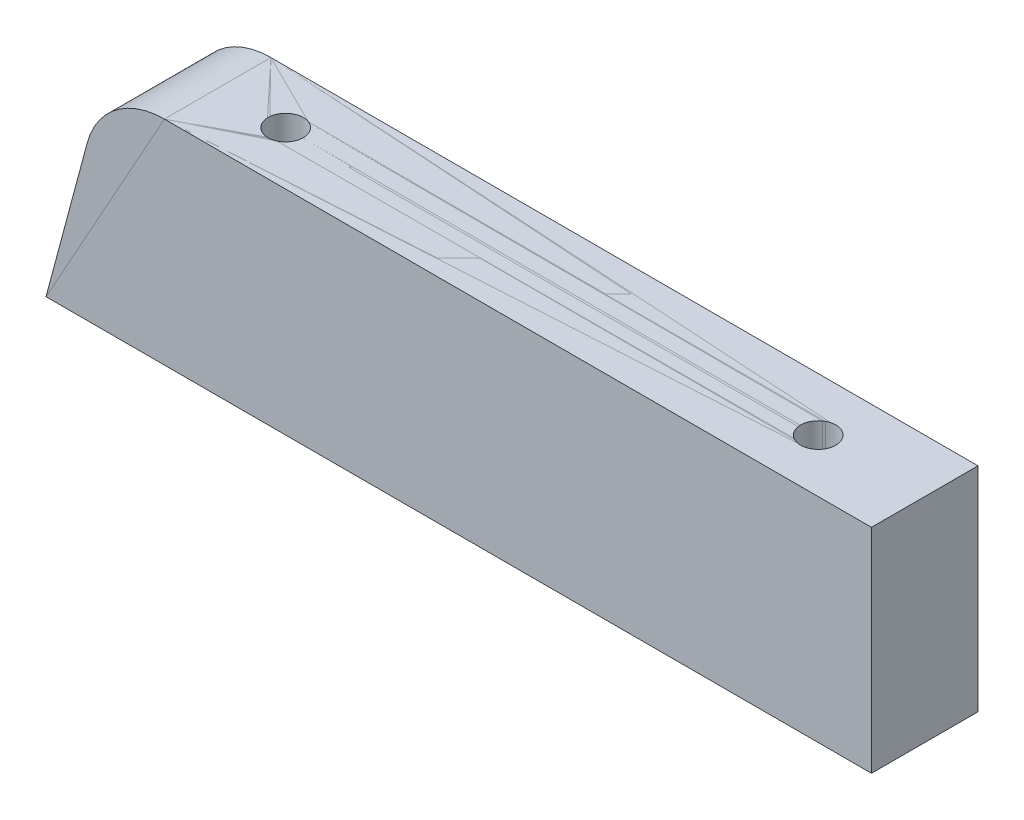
ISO-10303-21;
HEADER;
FILE_DESCRIPTION(('STEP AP214'),'2;1');
FILE_NAME('part.step','',(''),(''),'','','');
FILE_SCHEMA(('AUTOMOTIVE_DESIGN { 1 0 10303 214 1 1 1 1 }'));
ENDSEC;
DATA;
#1=APPLICATION_CONTEXT('core data for automotive mechanical design processes');
#2=APPLICATION_PROTOCOL_DEFINITION('international standard','automotive_design',2000,#1);
#3=PRODUCT_CONTEXT('',#1,'mechanical');
#4=PRODUCT('Part','Part','',(#3));
#5=PRODUCT_RELATED_PRODUCT_CATEGORY('part','',(#4));
#6=PRODUCT_DEFINITION_FORMATION('','',#4);
#7=PRODUCT_DEFINITION_CONTEXT('part definition',#1,'design');
#8=PRODUCT_DEFINITION('design','',#6,#7);
#9=PRODUCT_DEFINITION_SHAPE('','',#8);
#10=(LENGTH_UNIT() NAMED_UNIT(*) SI_UNIT(.MILLI.,.METRE.));
#11=(NAMED_UNIT(*) PLANE_ANGLE_UNIT() SI_UNIT($,.RADIAN.));
#12=(NAMED_UNIT(*) SI_UNIT($,.STERADIAN.) SOLID_ANGLE_UNIT());
#13=UNCERTAINTY_MEASURE_WITH_UNIT(LENGTH_MEASURE(1.E-05),#10,'distance_accuracy_value','');
#14=(GEOMETRIC_REPRESENTATION_CONTEXT(3) GLOBAL_UNCERTAINTY_ASSIGNED_CONTEXT((#13)) GLOBAL_UNIT_ASSIGNED_CONTEXT((#10,
#11,#12)) REPRESENTATION_CONTEXT('',''));
#15=CARTESIAN_POINT('',(0.,0.,0.));
#16=DIRECTION('',(0.,0.,1.));
#17=DIRECTION('',(1.,0.,0.));
#18=AXIS2_PLACEMENT_3D('',#15,#16,#17);
#19=CARTESIAN_POINT('',(69.843746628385,14.999999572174,-10.));
#20=DIRECTION('',(0.,-1.,0.));
#21=DIRECTION('',(0.,0.,-1.));
#22=AXIS2_PLACEMENT_3D('',#19,#20,#21);
#23=CYLINDRICAL_SURFACE('',#22,3.30000000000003);
#24=CARTESIAN_POINT('',(69.843746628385,14.999999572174,-10.));
#25=DIRECTION('',(0.,-1.,0.));
#26=DIRECTION('',(0.,0.,-1.));
#27=AXIS2_PLACEMENT_3D('',#24,#25,#26);
#28=CIRCLE('',#27,3.30000000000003);
#29=CARTESIAN_POINT('',(69.843746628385,14.999999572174,-13.3));
#30=VERTEX_POINT('',#29);
#31=EDGE_CURVE('P0_E436',#30,#30,#28,.T.);
#32=ORIENTED_EDGE('',*,*,#31,.F.);
#33=EDGE_LOOP('',(#32));
#34=FACE_BOUND('',#33,.T.);
#35=CARTESIAN_POINT('',(69.843746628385,-25.000000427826,-10.));
#36=DIRECTION('',(0.,-1.,0.));
#37=DIRECTION('',(0.,0.,-1.));
#38=AXIS2_PLACEMENT_3D('',#35,#36,#37);
#39=CIRCLE('',#38,3.30000000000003);
#40=CARTESIAN_POINT('',(69.843746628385,-25.000000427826,-13.3));
#41=VERTEX_POINT('',#40);
#42=EDGE_CURVE('P0_E355',#41,#41,#39,.F.);
#43=ORIENTED_EDGE('',*,*,#42,.F.);
#44=EDGE_LOOP('',(#43));
#45=FACE_BOUND('',#44,.T.);
#46=ADVANCED_FACE('P0_F351',(#34,#45),#23,.F.);
#47=CARTESIAN_POINT('',(-30.156253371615,14.999999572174,-10.));
#48=DIRECTION('',(0.,-1.,0.));
#49=DIRECTION('',(0.,0.,-1.));
#50=AXIS2_PLACEMENT_3D('',#47,#48,#49);
#51=CYLINDRICAL_SURFACE('',#50,3.3000000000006);
#52=CARTESIAN_POINT('',(-30.156253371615,14.999999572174,-10.));
#53=DIRECTION('',(0.,-1.,0.));
#54=DIRECTION('',(0.,0.,-1.));
#55=AXIS2_PLACEMENT_3D('',#52,#53,#54);
#56=CIRCLE('',#55,3.3000000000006);
#57=CARTESIAN_POINT('',(-30.156253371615,14.999999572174,-13.3000000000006));
#58=VERTEX_POINT('',#57);
#59=EDGE_CURVE('P0_E433',#58,#58,#56,.T.);
#60=ORIENTED_EDGE('',*,*,#59,.F.);
#61=EDGE_LOOP('',(#60));
#62=FACE_BOUND('',#61,.T.);
#63=CARTESIAN_POINT('',(-30.156253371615,-25.000000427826,-9.99999999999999));
#64=DIRECTION('',(0.,-1.,0.));
#65=DIRECTION('',(0.,0.,-1.));
#66=AXIS2_PLACEMENT_3D('',#63,#64,#65);
#67=CIRCLE('',#66,3.3000000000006);
#68=CARTESIAN_POINT('',(-30.156253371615,-25.000000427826,-13.3000000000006));
#69=VERTEX_POINT('',#68);
#70=EDGE_CURVE('P0_E439',#69,#69,#67,.F.);
#71=ORIENTED_EDGE('',*,*,#70,.F.);
#72=EDGE_LOOP('',(#71));
#73=FACE_BOUND('',#72,.T.);
#74=ADVANCED_FACE('P0_F504',(#62,#73),#51,.F.);
#75=CARTESIAN_POINT('',(89.843746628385,-25.000000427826,-20.));
#76=DIRECTION('',(0.,0.,-1.));
#77=DIRECTION('',(-1.,0.,0.));
#78=AXIS2_PLACEMENT_3D('',#75,#76,#77);
#79=PLANE('',#78);
#80=DIRECTION('',(0.,1.,0.));
#81=VECTOR('',#80,1.);
#82=CARTESIAN_POINT('',(89.843746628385,-5.000000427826,-20.));
#83=LINE('',#82,#81);
#84=CARTESIAN_POINT('',(89.843746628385,-25.000000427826,-20.0000000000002));
#85=VERTEX_POINT('',#84);
#86=CARTESIAN_POINT('',(89.843746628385,14.999999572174,-20.0000000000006));
#87=VERTEX_POINT('',#86);
#88=EDGE_CURVE('P0_E396',#85,#87,#83,.T.);
#89=ORIENTED_EDGE('',*,*,#88,.F.);
#90=DIRECTION('',(1.,0.,0.));
#91=VECTOR('',#90,1.);
#92=CARTESIAN_POINT('',(12.343746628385,-25.000000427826,-20.0000000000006));
#93=LINE('',#92,#91);
#94=CARTESIAN_POINT('',(-65.156253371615,-25.000000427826,-20.0000000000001));
#95=VERTEX_POINT('',#94);
#96=EDGE_CURVE('P0_E445',#95,#85,#93,.T.);
#97=ORIENTED_EDGE('',*,*,#96,.F.);
#98=DIRECTION('',(-0.258819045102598,-0.965925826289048,0.));
#99=VECTOR('',#98,1.);
#100=CARTESIAN_POINT('',(-61.286760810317,-10.5588575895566,-19.9999999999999));
#101=LINE('',#100,#99);
#102=CARTESIAN_POINT('',(-57.417268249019,3.88228524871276,-20.));
#103=VERTEX_POINT('',#102);
#104=EDGE_CURVE('P0_E421',#103,#95,#101,.T.);
#105=ORIENTED_EDGE('',*,*,#104,.F.);
#106=CARTESIAN_POINT('',(-42.928380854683,-4.27826329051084E-07,-20.));
#107=DIRECTION('',(0.,0.,1.));
#108=DIRECTION('',(1.,0.,0.));
#109=AXIS2_PLACEMENT_3D('',#106,#107,#108);
#110=CIRCLE('',#109,14.9999999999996);
#111=CARTESIAN_POINT('',(-42.9283808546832,14.9999995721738,-20.0000000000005));
#112=VERTEX_POINT('',#111);
#113=EDGE_CURVE('P0_E380',#103,#112,#110,.F.);
#114=ORIENTED_EDGE('',*,*,#113,.T.);
#115=DIRECTION('',(-1.,0.,0.));
#116=VECTOR('',#115,1.);
#117=CARTESIAN_POINT('',(23.457682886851,14.999999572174,-20.000000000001));
#118=LINE('',#117,#116);
#119=EDGE_CURVE('P0_E438',#87,#112,#118,.T.);
#120=ORIENTED_EDGE('',*,*,#119,.F.);
#121=EDGE_LOOP('',(#89,#97,#105,#114,#120));
#122=FACE_BOUND('',#121,.T.);
#123=ADVANCED_FACE('P0_F500',(#122),#79,.T.);
#124=CARTESIAN_POINT('',(-65.156253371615,-25.000000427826,0.));
#125=DIRECTION('',(0.,-1.,0.));
#126=DIRECTION('',(0.,0.,-1.));
#127=AXIS2_PLACEMENT_3D('',#124,#125,#126);
#128=PLANE('',#127);
#129=ORIENTED_EDGE('',*,*,#70,.T.);
#130=EDGE_LOOP('',(#129));
#131=FACE_BOUND('',#130,.T.);
#132=ORIENTED_EDGE('',*,*,#42,.T.);
#133=EDGE_LOOP('',(#132));
#134=FACE_BOUND('',#133,.T.);
#135=ORIENTED_EDGE('',*,*,#96,.T.);
#136=DIRECTION('',(0.,0.,-1.));
#137=VECTOR('',#136,1.);
#138=CARTESIAN_POINT('',(89.843746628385,-25.000000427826,-20.));
#139=LINE('',#138,#137);
#140=CARTESIAN_POINT('',(89.843746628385,-25.000000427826,0.));
#141=VERTEX_POINT('',#140);
#142=EDGE_CURVE('P0_E412',#141,#85,#139,.T.);
#143=ORIENTED_EDGE('',*,*,#142,.F.);
#144=DIRECTION('',(1.,0.,0.));
#145=VECTOR('',#144,1.);
#146=CARTESIAN_POINT('',(12.343746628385,-25.000000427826,0.));
#147=LINE('',#146,#145);
#148=CARTESIAN_POINT('',(-65.156253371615,-25.000000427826,0.));
#149=VERTEX_POINT('',#148);
#150=EDGE_CURVE('P0_E407',#149,#141,#147,.T.);
#151=ORIENTED_EDGE('',*,*,#150,.F.);
#152=DIRECTION('',(0.,0.,1.));
#153=VECTOR('',#152,1.);
#154=CARTESIAN_POINT('',(-65.156253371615,-25.000000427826,-14.9505711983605));
#155=LINE('',#154,#153);
#156=EDGE_CURVE('P0_E410',#95,#149,#155,.T.);
#157=ORIENTED_EDGE('',*,*,#156,.F.);
#158=EDGE_LOOP('',(#135,#143,#151,#157));
#159=FACE_BOUND('',#158,.T.);
#160=ADVANCED_FACE('P0_F409',(#131,#134,#159),#128,.T.);
#161=CARTESIAN_POINT('',(89.843746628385,-25.000000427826,0.));
#162=DIRECTION('',(1.,0.,0.));
#163=DIRECTION('',(0.,0.,-1.));
#164=AXIS2_PLACEMENT_3D('',#161,#162,#163);
#165=PLANE('',#164);
#166=ORIENTED_EDGE('',*,*,#88,.T.);
#167=DIRECTION('',(0.,0.,-1.));
#168=VECTOR('',#167,1.);
#169=CARTESIAN_POINT('',(89.843746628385,14.999999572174,-66.386063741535));
#170=LINE('',#169,#168);
#171=CARTESIAN_POINT('',(89.843746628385,14.9999995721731,0.));
#172=VERTEX_POINT('',#171);
#173=EDGE_CURVE('P0_E463',#172,#87,#170,.T.);
#174=ORIENTED_EDGE('',*,*,#173,.F.);
#175=DIRECTION('',(0.,1.,0.));
#176=VECTOR('',#175,1.);
#177=CARTESIAN_POINT('',(89.843746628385,52.499999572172,0.));
#178=LINE('',#177,#176);
#179=EDGE_CURVE('P0_E416',#141,#172,#178,.T.);
#180=ORIENTED_EDGE('',*,*,#179,.F.);
#181=ORIENTED_EDGE('',*,*,#142,.T.);
#182=EDGE_LOOP('',(#166,#174,#180,#181));
#183=FACE_BOUND('',#182,.T.);
#184=ADVANCED_FACE('P0_F479',(#183),#165,.T.);
#185=CARTESIAN_POINT('',(89.843746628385,14.999999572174,0.));
#186=DIRECTION('',(0.,1.,0.));
#187=DIRECTION('',(0.,0.,-1.));
#188=AXIS2_PLACEMENT_3D('',#185,#186,#187);
#189=PLANE('',#188);
#190=ORIENTED_EDGE('',*,*,#59,.T.);
#191=EDGE_LOOP('',(#190));
#192=FACE_BOUND('',#191,.T.);
#193=ORIENTED_EDGE('',*,*,#31,.T.);
#194=EDGE_LOOP('',(#193));
#195=FACE_BOUND('',#194,.T.);
#196=ORIENTED_EDGE('',*,*,#119,.T.);
#197=DIRECTION('',(0.,0.,1.));
#198=VECTOR('',#197,1.);
#199=CARTESIAN_POINT('',(-42.9283808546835,14.9999995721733,-10.));
#200=LINE('',#199,#198);
#201=CARTESIAN_POINT('',(-42.9283808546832,14.999999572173,0.));
#202=VERTEX_POINT('',#201);
#203=EDGE_CURVE('P0_E432',#112,#202,#200,.T.);
#204=ORIENTED_EDGE('',*,*,#203,.T.);
#205=DIRECTION('',(-1.,0.,0.));
#206=VECTOR('',#205,1.);
#207=CARTESIAN_POINT('',(12.343746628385,14.9999995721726,0.));
#208=LINE('',#207,#206);
#209=EDGE_CURVE('P0_E425',#172,#202,#208,.T.);
#210=ORIENTED_EDGE('',*,*,#209,.F.);
#211=ORIENTED_EDGE('',*,*,#173,.T.);
#212=EDGE_LOOP('',(#196,#204,#210,#211));
#213=FACE_BOUND('',#212,.T.);
#214=ADVANCED_FACE('P0_F481',(#192,#195,#213),#189,.T.);
#215=CARTESIAN_POINT('',(-42.928380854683,-4.27826329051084E-07,-20.));
#216=DIRECTION('',(0.,0.,1.));
#217=DIRECTION('',(1.,0.,0.));
#218=AXIS2_PLACEMENT_3D('',#215,#216,#217);
#219=CYLINDRICAL_SURFACE('',#218,14.9999999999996);
#220=ORIENTED_EDGE('',*,*,#203,.F.);
#221=ORIENTED_EDGE('',*,*,#113,.F.);
#222=DIRECTION('',(0.,0.,-1.));
#223=VECTOR('',#222,1.);
#224=CARTESIAN_POINT('',(-57.417268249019,3.8822852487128,-14.9505711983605));
#225=LINE('',#224,#223);
#226=CARTESIAN_POINT('',(-57.4172682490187,3.88228524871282,0.));
#227=VERTEX_POINT('',#226);
#228=EDGE_CURVE('P0_E370',#227,#103,#225,.T.);
#229=ORIENTED_EDGE('',*,*,#228,.F.);
#230=CARTESIAN_POINT('',(-42.928380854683,-4.27826330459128E-07,0.));
#231=DIRECTION('',(0.,0.,1.));
#232=DIRECTION('',(1.,0.,0.));
#233=AXIS2_PLACEMENT_3D('',#230,#231,#232);
#234=CIRCLE('',#233,14.9999999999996);
#235=EDGE_CURVE('P0_E361',#202,#227,#234,.T.);
#236=ORIENTED_EDGE('',*,*,#235,.F.);
#237=EDGE_LOOP('',(#220,#221,#229,#236));
#238=FACE_BOUND('',#237,.T.);
#239=ADVANCED_FACE('P0_F482',(#238),#219,.T.);
#240=CARTESIAN_POINT('',(-57.417268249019,3.8822852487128,0.));
#241=DIRECTION('',(-0.965925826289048,0.258819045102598,0.));
#242=DIRECTION('',(0.,0.,-1.));
#243=AXIS2_PLACEMENT_3D('',#240,#241,#242);
#244=PLANE('',#243);
#245=ORIENTED_EDGE('',*,*,#104,.T.);
#246=ORIENTED_EDGE('',*,*,#156,.T.);
#247=DIRECTION('',(-0.258819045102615,-0.965925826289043,0.));
#248=VECTOR('',#247,1.);
#249=CARTESIAN_POINT('',(-57.4172682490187,3.88228524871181,0.));
#250=LINE('',#249,#248);
#251=EDGE_CURVE('P0_E12',#227,#149,#250,.T.);
#252=ORIENTED_EDGE('',*,*,#251,.F.);
#253=ORIENTED_EDGE('',*,*,#228,.T.);
#254=EDGE_LOOP('',(#245,#246,#252,#253));
#255=FACE_BOUND('',#254,.T.);
#256=ADVANCED_FACE('P0_F419',(#255),#244,.T.);
#257=CARTESIAN_POINT('',(-65.156253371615,-25.000000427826,0.));
#258=DIRECTION('',(0.,0.,1.));
#259=DIRECTION('',(1.,0.,0.));
#260=AXIS2_PLACEMENT_3D('',#257,#258,#259);
#261=PLANE('',#260);
#262=ORIENTED_EDGE('',*,*,#235,.T.);
#263=ORIENTED_EDGE('',*,*,#251,.T.);
#264=ORIENTED_EDGE('',*,*,#150,.T.);
#265=ORIENTED_EDGE('',*,*,#179,.T.);
#266=ORIENTED_EDGE('',*,*,#209,.T.);
#267=EDGE_LOOP('',(#262,#263,#264,#265,#266));
#268=FACE_BOUND('',#267,.T.);
#269=ADVANCED_FACE('P0_F353',(#268),#261,.T.);
#270=CLOSED_SHELL('',(#46,#74,#123,#160,#184,#214,#239,#256,#269));
#271=MANIFOLD_SOLID_BREP('P0_B2',#270);
#272=CARTESIAN_POINT('',(69.843746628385,14.999999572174,-10.));
#273=DIRECTION('',(0.,-1.,0.));
#274=DIRECTION('',(0.,0.,-1.));
#275=AXIS2_PLACEMENT_3D('',#272,#273,#274);
#276=CYLINDRICAL_SURFACE('',#275,3.30000000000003);
#277=CARTESIAN_POINT('',(69.843746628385,14.999999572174,-10.));
#278=DIRECTION('',(0.,-1.,0.));
#279=DIRECTION('',(0.,0.,-1.));
#280=AXIS2_PLACEMENT_3D('',#277,#278,#279);
#281=CIRCLE('',#280,3.30000000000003);
#282=CARTESIAN_POINT('',(69.843746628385,14.999999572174,-13.3));
#283=VERTEX_POINT('',#282);
#284=EDGE_CURVE('P1_E103',#283,#283,#281,.T.);
#285=ORIENTED_EDGE('',*,*,#284,.F.);
#286=EDGE_LOOP('',(#285));
#287=FACE_BOUND('',#286,.T.);
#288=CARTESIAN_POINT('',(69.843746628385,-25.000000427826,-10.));
#289=DIRECTION('',(0.,-1.,0.));
#290=DIRECTION('',(0.,0.,-1.));
#291=AXIS2_PLACEMENT_3D('',#288,#289,#290);
#292=CIRCLE('',#291,3.30000000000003);
#293=CARTESIAN_POINT('',(69.843746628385,-25.000000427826,-13.3));
#294=VERTEX_POINT('',#293);
#295=EDGE_CURVE('P1_E23',#294,#294,#292,.F.);
#296=ORIENTED_EDGE('',*,*,#295,.F.);
#297=EDGE_LOOP('',(#296));
#298=FACE_BOUND('',#297,.T.);
#299=ADVANCED_FACE('P1_F19',(#287,#298),#276,.F.);
#300=CARTESIAN_POINT('',(-30.156253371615,14.999999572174,-10.));
#301=DIRECTION('',(0.,-1.,0.));
#302=DIRECTION('',(0.,0.,-1.));
#303=AXIS2_PLACEMENT_3D('',#300,#301,#302);
#304=CYLINDRICAL_SURFACE('',#303,3.3000000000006);
#305=CARTESIAN_POINT('',(-30.156253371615,14.999999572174,-10.));
#306=DIRECTION('',(0.,-1.,0.));
#307=DIRECTION('',(0.,0.,-1.));
#308=AXIS2_PLACEMENT_3D('',#305,#306,#307);
#309=CIRCLE('',#308,3.3000000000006);
#310=CARTESIAN_POINT('',(-30.156253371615,14.999999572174,-13.3000000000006));
#311=VERTEX_POINT('',#310);
#312=EDGE_CURVE('P1_E100',#311,#311,#309,.T.);
#313=ORIENTED_EDGE('',*,*,#312,.F.);
#314=EDGE_LOOP('',(#313));
#315=FACE_BOUND('',#314,.T.);
#316=CARTESIAN_POINT('',(-30.156253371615,-25.000000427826,-9.99999999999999));
#317=DIRECTION('',(0.,-1.,0.));
#318=DIRECTION('',(0.,0.,-1.));
#319=AXIS2_PLACEMENT_3D('',#316,#317,#318);
#320=CIRCLE('',#319,3.3000000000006);
#321=CARTESIAN_POINT('',(-30.156253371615,-25.000000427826,-13.3000000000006));
#322=VERTEX_POINT('',#321);
#323=EDGE_CURVE('P1_E106',#322,#322,#320,.F.);
#324=ORIENTED_EDGE('',*,*,#323,.F.);
#325=EDGE_LOOP('',(#324));
#326=FACE_BOUND('',#325,.T.);
#327=ADVANCED_FACE('P1_F175',(#315,#326),#304,.F.);
#328=CARTESIAN_POINT('',(89.843746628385,-25.000000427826,-20.));
#329=DIRECTION('',(0.,0.,-1.));
#330=DIRECTION('',(-1.,0.,0.));
#331=AXIS2_PLACEMENT_3D('',#328,#329,#330);
#332=PLANE('',#331);
#333=DIRECTION('',(0.,1.,0.));
#334=VECTOR('',#333,1.);
#335=CARTESIAN_POINT('',(89.843746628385,-5.000000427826,-20.));
#336=LINE('',#335,#334);
#337=CARTESIAN_POINT('',(89.843746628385,-25.000000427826,-20.0000000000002));
#338=VERTEX_POINT('',#337);
#339=CARTESIAN_POINT('',(89.843746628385,14.999999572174,-20.0000000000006));
#340=VERTEX_POINT('',#339);
#341=EDGE_CURVE('P1_E64',#338,#340,#336,.T.);
#342=ORIENTED_EDGE('',*,*,#341,.F.);
#343=DIRECTION('',(1.,0.,0.));
#344=VECTOR('',#343,1.);
#345=CARTESIAN_POINT('',(12.343746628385,-25.000000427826,-20.0000000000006));
#346=LINE('',#345,#344);
#347=CARTESIAN_POINT('',(-65.156253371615,-25.000000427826,-20.0000000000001));
#348=VERTEX_POINT('',#347);
#349=EDGE_CURVE('P1_E112',#348,#338,#346,.T.);
#350=ORIENTED_EDGE('',*,*,#349,.F.);
#351=DIRECTION('',(-0.258819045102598,-0.965925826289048,0.));
#352=VECTOR('',#351,1.);
#353=CARTESIAN_POINT('',(-61.286760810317,-10.5588575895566,-19.9999999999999));
#354=LINE('',#353,#352);
#355=CARTESIAN_POINT('',(-57.417268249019,3.88228524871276,-20.));
#356=VERTEX_POINT('',#355);
#357=EDGE_CURVE('P1_E89',#356,#348,#354,.T.);
#358=ORIENTED_EDGE('',*,*,#357,.F.);
#359=CARTESIAN_POINT('',(-42.928380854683,-4.27826329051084E-07,-20.));
#360=DIRECTION('',(0.,0.,1.));
#361=DIRECTION('',(1.,0.,0.));
#362=AXIS2_PLACEMENT_3D('',#359,#360,#361);
#363=CIRCLE('',#362,14.9999999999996);
#364=CARTESIAN_POINT('',(-42.9283808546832,14.9999995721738,-20.0000000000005));
#365=VERTEX_POINT('',#364);
#366=EDGE_CURVE('P1_E48',#356,#365,#363,.F.);
#367=ORIENTED_EDGE('',*,*,#366,.T.);
#368=DIRECTION('',(-1.,0.,0.));
#369=VECTOR('',#368,1.);
#370=CARTESIAN_POINT('',(23.457682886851,14.999999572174,-20.000000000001));
#371=LINE('',#370,#369);
#372=EDGE_CURVE('P1_E105',#340,#365,#371,.T.);
#373=ORIENTED_EDGE('',*,*,#372,.F.);
#374=EDGE_LOOP('',(#342,#350,#358,#367,#373));
#375=FACE_BOUND('',#374,.T.);
#376=ADVANCED_FACE('P1_F171',(#375),#332,.T.);
#377=CARTESIAN_POINT('',(-65.156253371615,-25.000000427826,0.));
#378=DIRECTION('',(0.,-1.,0.));
#379=DIRECTION('',(0.,0.,-1.));
#380=AXIS2_PLACEMENT_3D('',#377,#378,#379);
#381=PLANE('',#380);
#382=ORIENTED_EDGE('',*,*,#323,.T.);
#383=EDGE_LOOP('',(#382));
#384=FACE_BOUND('',#383,.T.);
#385=ORIENTED_EDGE('',*,*,#295,.T.);
#386=EDGE_LOOP('',(#385));
#387=FACE_BOUND('',#386,.T.);
#388=ORIENTED_EDGE('',*,*,#349,.T.);
#389=DIRECTION('',(0.,0.,-1.));
#390=VECTOR('',#389,1.);
#391=CARTESIAN_POINT('',(89.843746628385,-25.000000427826,-20.));
#392=LINE('',#391,#390);
#393=CARTESIAN_POINT('',(89.843746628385,-25.000000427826,0.));
#394=VERTEX_POINT('',#393);
#395=EDGE_CURVE('P1_E80',#394,#338,#392,.T.);
#396=ORIENTED_EDGE('',*,*,#395,.F.);
#397=DIRECTION('',(1.,0.,0.));
#398=VECTOR('',#397,1.);
#399=CARTESIAN_POINT('',(12.343746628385,-25.000000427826,0.));
#400=LINE('',#399,#398);
#401=CARTESIAN_POINT('',(-65.156253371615,-25.000000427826,0.));
#402=VERTEX_POINT('',#401);
#403=EDGE_CURVE('P1_E75',#402,#394,#400,.T.);
#404=ORIENTED_EDGE('',*,*,#403,.F.);
#405=DIRECTION('',(0.,0.,1.));
#406=VECTOR('',#405,1.);
#407=CARTESIAN_POINT('',(-65.156253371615,-25.000000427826,-14.9505711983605));
#408=LINE('',#407,#406);
#409=EDGE_CURVE('P1_E78',#348,#402,#408,.T.);
#410=ORIENTED_EDGE('',*,*,#409,.F.);
#411=EDGE_LOOP('',(#388,#396,#404,#410));
#412=FACE_BOUND('',#411,.T.);
#413=ADVANCED_FACE('P1_F77',(#384,#387,#412),#381,.T.);
#414=CARTESIAN_POINT('',(89.843746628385,-25.000000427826,0.));
#415=DIRECTION('',(1.,0.,0.));
#416=DIRECTION('',(0.,0.,-1.));
#417=AXIS2_PLACEMENT_3D('',#414,#415,#416);
#418=PLANE('',#417);
#419=ORIENTED_EDGE('',*,*,#341,.T.);
#420=DIRECTION('',(0.,0.,-1.));
#421=VECTOR('',#420,1.);
#422=CARTESIAN_POINT('',(89.843746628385,14.999999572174,-66.386063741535));
#423=LINE('',#422,#421);
#424=CARTESIAN_POINT('',(89.843746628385,14.9999995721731,0.));
#425=VERTEX_POINT('',#424);
#426=EDGE_CURVE('P1_E130',#425,#340,#423,.T.);
#427=ORIENTED_EDGE('',*,*,#426,.F.);
#428=DIRECTION('',(0.,1.,0.));
#429=VECTOR('',#428,1.);
#430=CARTESIAN_POINT('',(89.843746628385,52.499999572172,0.));
#431=LINE('',#430,#429);
#432=EDGE_CURVE('P1_E84',#394,#425,#431,.T.);
#433=ORIENTED_EDGE('',*,*,#432,.F.);
#434=ORIENTED_EDGE('',*,*,#395,.T.);
#435=EDGE_LOOP('',(#419,#427,#433,#434));
#436=FACE_BOUND('',#435,.T.);
#437=ADVANCED_FACE('P1_F146',(#436),#418,.T.);
#438=CARTESIAN_POINT('',(89.843746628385,14.999999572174,0.));
#439=DIRECTION('',(0.,1.,0.));
#440=DIRECTION('',(0.,0.,-1.));
#441=AXIS2_PLACEMENT_3D('',#438,#439,#440);
#442=PLANE('',#441);
#443=ORIENTED_EDGE('',*,*,#312,.T.);
#444=EDGE_LOOP('',(#443));
#445=FACE_BOUND('',#444,.T.);
#446=ORIENTED_EDGE('',*,*,#284,.T.);
#447=EDGE_LOOP('',(#446));
#448=FACE_BOUND('',#447,.T.);
#449=ORIENTED_EDGE('',*,*,#372,.T.);
#450=DIRECTION('',(0.,0.,1.));
#451=VECTOR('',#450,1.);
#452=CARTESIAN_POINT('',(-42.9283808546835,14.9999995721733,-10.));
#453=LINE('',#452,#451);
#454=CARTESIAN_POINT('',(-42.9283808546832,14.999999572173,0.));
#455=VERTEX_POINT('',#454);
#456=EDGE_CURVE('P1_E99',#365,#455,#453,.T.);
#457=ORIENTED_EDGE('',*,*,#456,.T.);
#458=DIRECTION('',(-1.,0.,0.));
#459=VECTOR('',#458,1.);
#460=CARTESIAN_POINT('',(12.343746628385,14.9999995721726,0.));
#461=LINE('',#460,#459);
#462=EDGE_CURVE('P1_E93',#425,#455,#461,.T.);
#463=ORIENTED_EDGE('',*,*,#462,.F.);
#464=ORIENTED_EDGE('',*,*,#426,.T.);
#465=EDGE_LOOP('',(#449,#457,#463,#464));
#466=FACE_BOUND('',#465,.T.);
#467=ADVANCED_FACE('P1_F148',(#445,#448,#466),#442,.T.);
#468=CARTESIAN_POINT('',(-42.928380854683,-4.27826329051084E-07,-20.));
#469=DIRECTION('',(0.,0.,1.));
#470=DIRECTION('',(1.,0.,0.));
#471=AXIS2_PLACEMENT_3D('',#468,#469,#470);
#472=CYLINDRICAL_SURFACE('',#471,14.9999999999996);
#473=ORIENTED_EDGE('',*,*,#456,.F.);
#474=ORIENTED_EDGE('',*,*,#366,.F.);
#475=DIRECTION('',(0.,0.,-1.));
#476=VECTOR('',#475,1.);
#477=CARTESIAN_POINT('',(-57.417268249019,3.8822852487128,-14.9505711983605));
#478=LINE('',#477,#476);
#479=CARTESIAN_POINT('',(-57.4172682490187,3.88228524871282,0.));
#480=VERTEX_POINT('',#479);
#481=EDGE_CURVE('P1_E38',#480,#356,#478,.T.);
#482=ORIENTED_EDGE('',*,*,#481,.F.);
#483=CARTESIAN_POINT('',(-42.928380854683,-4.27826330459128E-07,0.));
#484=DIRECTION('',(0.,0.,1.));
#485=DIRECTION('',(1.,0.,0.));
#486=AXIS2_PLACEMENT_3D('',#483,#484,#485);
#487=CIRCLE('',#486,14.9999999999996);
#488=EDGE_CURVE('P1_E29',#455,#480,#487,.T.);
#489=ORIENTED_EDGE('',*,*,#488,.F.);
#490=EDGE_LOOP('',(#473,#474,#482,#489));
#491=FACE_BOUND('',#490,.T.);
#492=ADVANCED_FACE('P1_F149',(#491),#472,.T.);
#493=CARTESIAN_POINT('',(-57.417268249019,3.8822852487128,0.));
#494=DIRECTION('',(-0.965925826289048,0.258819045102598,0.));
#495=DIRECTION('',(0.,0.,-1.));
#496=AXIS2_PLACEMENT_3D('',#493,#494,#495);
#497=PLANE('',#496);
#498=ORIENTED_EDGE('',*,*,#357,.T.);
#499=ORIENTED_EDGE('',*,*,#409,.T.);
#500=DIRECTION('',(-0.258819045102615,-0.965925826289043,0.));
#501=VECTOR('',#500,1.);
#502=CARTESIAN_POINT('',(-57.4172682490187,3.88228524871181,0.));
#503=LINE('',#502,#501);
#504=EDGE_CURVE('P1_E11',#480,#402,#503,.T.);
#505=ORIENTED_EDGE('',*,*,#504,.F.);
#506=ORIENTED_EDGE('',*,*,#481,.T.);
#507=EDGE_LOOP('',(#498,#499,#505,#506));
#508=FACE_BOUND('',#507,.T.);
#509=ADVANCED_FACE('P1_F87',(#508),#497,.T.);
#510=CARTESIAN_POINT('',(-65.156253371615,-25.000000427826,0.));
#511=DIRECTION('',(0.,0.,1.));
#512=DIRECTION('',(1.,0.,0.));
#513=AXIS2_PLACEMENT_3D('',#510,#511,#512);
#514=PLANE('',#513);
#515=ORIENTED_EDGE('',*,*,#488,.T.);
#516=ORIENTED_EDGE('',*,*,#504,.T.);
#517=ORIENTED_EDGE('',*,*,#403,.T.);
#518=ORIENTED_EDGE('',*,*,#432,.T.);
#519=ORIENTED_EDGE('',*,*,#462,.T.);
#520=EDGE_LOOP('',(#515,#516,#517,#518,#519));
#521=FACE_BOUND('',#520,.T.);
#522=ADVANCED_FACE('P1_F21',(#521),#514,.T.);
#523=CLOSED_SHELL('',(#299,#327,#376,#413,#437,#467,#492,#509,#522));
#524=MANIFOLD_SOLID_BREP('P1_B1',#523);
#525=ADVANCED_BREP_SHAPE_REPRESENTATION('',(#18,#271,#524),#14);
#526=SHAPE_DEFINITION_REPRESENTATION(#9,#525);
ENDSEC;
END-ISO-10303-21;
